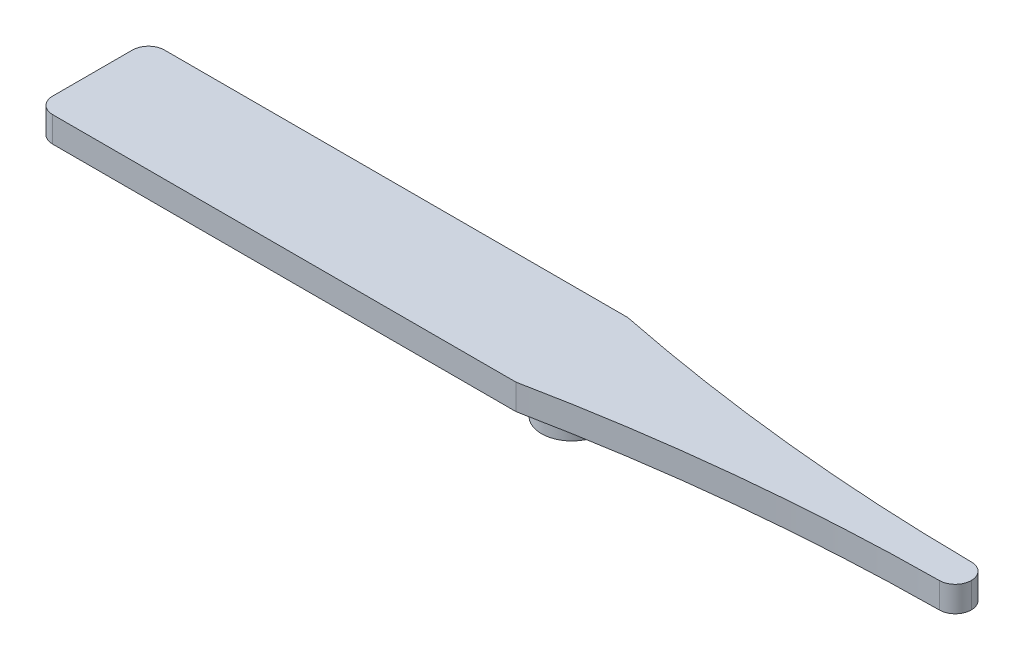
ISO-10303-21;
HEADER;
FILE_DESCRIPTION(('STEP AP214'),'2;1');
FILE_NAME('part.step','',(''),(''),'','','');
FILE_SCHEMA(('AUTOMOTIVE_DESIGN { 1 0 10303 214 1 1 1 1 }'));
ENDSEC;
DATA;
#1=APPLICATION_CONTEXT('core data for automotive mechanical design processes');
#2=APPLICATION_PROTOCOL_DEFINITION('international standard','automotive_design',2000,#1);
#3=PRODUCT_CONTEXT('',#1,'mechanical');
#4=PRODUCT('Part','Part','',(#3));
#5=PRODUCT_RELATED_PRODUCT_CATEGORY('part','',(#4));
#6=PRODUCT_DEFINITION_FORMATION('','',#4);
#7=PRODUCT_DEFINITION_CONTEXT('part definition',#1,'design');
#8=PRODUCT_DEFINITION('design','',#6,#7);
#9=PRODUCT_DEFINITION_SHAPE('','',#8);
#10=(LENGTH_UNIT() NAMED_UNIT(*) SI_UNIT(.MILLI.,.METRE.));
#11=(NAMED_UNIT(*) PLANE_ANGLE_UNIT() SI_UNIT($,.RADIAN.));
#12=(NAMED_UNIT(*) SI_UNIT($,.STERADIAN.) SOLID_ANGLE_UNIT());
#13=UNCERTAINTY_MEASURE_WITH_UNIT(LENGTH_MEASURE(1.E-05),#10,'distance_accuracy_value','');
#14=(GEOMETRIC_REPRESENTATION_CONTEXT(3) GLOBAL_UNCERTAINTY_ASSIGNED_CONTEXT((#13)) GLOBAL_UNIT_ASSIGNED_CONTEXT((#10,
#11,#12)) REPRESENTATION_CONTEXT('',''));
#15=CARTESIAN_POINT('',(0.,0.,0.));
#16=DIRECTION('',(0.,0.,1.));
#17=DIRECTION('',(1.,0.,0.));
#18=AXIS2_PLACEMENT_3D('',#15,#16,#17);
#19=CARTESIAN_POINT('',(25.,1.6,-127.25));
#20=DIRECTION('',(0.,-1.,0.));
#21=DIRECTION('',(0.,0.,-1.));
#22=AXIS2_PLACEMENT_3D('',#19,#20,#21);
#23=CYLINDRICAL_SURFACE('',#22,126.25);
#24=CARTESIAN_POINT('',(25.,0.,-127.25));
#25=DIRECTION('',(0.,1.,0.));
#26=DIRECTION('',(0.,0.,1.));
#27=AXIS2_PLACEMENT_3D('',#24,#25,#26);
#28=CIRCLE('',#27,126.25);
#29=CARTESIAN_POINT('',(0.0974471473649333,0.,-3.4803536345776));
#30=VERTEX_POINT('',#29);
#31=CARTESIAN_POINT('',(24.007858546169,0.,-1.00389845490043));
#32=VERTEX_POINT('',#31);
#33=EDGE_CURVE('E177',#30,#32,#28,.T.);
#34=ORIENTED_EDGE('',*,*,#33,.F.);
#35=DIRECTION('',(0.,-1.,0.));
#36=VECTOR('',#35,1.);
#37=CARTESIAN_POINT('',(0.0974471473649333,1.6,-3.4803536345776));
#38=LINE('',#37,#36);
#39=CARTESIAN_POINT('',(0.0974471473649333,1.6,-3.4803536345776));
#40=VERTEX_POINT('',#39);
#41=EDGE_CURVE('E221',#30,#40,#38,.F.);
#42=ORIENTED_EDGE('',*,*,#41,.T.);
#43=CARTESIAN_POINT('',(25.,1.6,-127.25));
#44=DIRECTION('',(0.,1.,0.));
#45=DIRECTION('',(0.,0.,1.));
#46=AXIS2_PLACEMENT_3D('',#43,#44,#45);
#47=CIRCLE('',#46,126.25);
#48=CARTESIAN_POINT('',(24.007858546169,1.6,-1.00389845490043));
#49=VERTEX_POINT('',#48);
#50=EDGE_CURVE('E263',#40,#49,#47,.T.);
#51=ORIENTED_EDGE('',*,*,#50,.T.);
#52=DIRECTION('',(0.,-1.,0.));
#53=VECTOR('',#52,1.);
#54=CARTESIAN_POINT('',(24.007858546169,1.6,-1.00389845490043));
#55=LINE('',#54,#53);
#56=EDGE_CURVE('E217',#49,#32,#55,.T.);
#57=ORIENTED_EDGE('',*,*,#56,.T.);
#58=EDGE_LOOP('',(#34,#42,#51,#57));
#59=FACE_BOUND('',#58,.T.);
#60=ADVANCED_FACE('F62',(#59),#23,.F.);
#61=CARTESIAN_POINT('',(0.,1.6,-3.5));
#62=DIRECTION('',(0.,0.,1.));
#63=DIRECTION('',(1.,0.,0.));
#64=AXIS2_PLACEMENT_3D('',#61,#62,#63);
#65=PLANE('',#64);
#66=DIRECTION('',(-1.,0.,0.));
#67=VECTOR('',#66,1.);
#68=CARTESIAN_POINT('',(0.,1.6,-3.5));
#69=LINE('',#68,#67);
#70=CARTESIAN_POINT('',(-0.0998007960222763,1.6,-3.5));
#71=VERTEX_POINT('',#70);
#72=CARTESIAN_POINT('',(-29.,1.6,-3.50000000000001));
#73=VERTEX_POINT('',#72);
#74=EDGE_CURVE('E169',#71,#73,#69,.T.);
#75=ORIENTED_EDGE('',*,*,#74,.F.);
#76=DIRECTION('',(0.,1.,0.));
#77=VECTOR('',#76,1.);
#78=CARTESIAN_POINT('',(-0.0998007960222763,0.,-3.5));
#79=LINE('',#78,#77);
#80=CARTESIAN_POINT('',(-0.0998007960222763,0.,-3.5));
#81=VERTEX_POINT('',#80);
#82=EDGE_CURVE('E198',#71,#81,#79,.F.);
#83=ORIENTED_EDGE('',*,*,#82,.T.);
#84=DIRECTION('',(-1.,0.,0.));
#85=VECTOR('',#84,1.);
#86=CARTESIAN_POINT('',(0.,0.,-3.5));
#87=LINE('',#86,#85);
#88=CARTESIAN_POINT('',(-29.,0.,-3.50000000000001));
#89=VERTEX_POINT('',#88);
#90=EDGE_CURVE('E182',#81,#89,#87,.T.);
#91=ORIENTED_EDGE('',*,*,#90,.T.);
#92=DIRECTION('',(0.,-1.,0.));
#93=VECTOR('',#92,1.);
#94=CARTESIAN_POINT('',(-29.,1.6,-3.50000000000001));
#95=LINE('',#94,#93);
#96=EDGE_CURVE('E156',#89,#73,#95,.F.);
#97=ORIENTED_EDGE('',*,*,#96,.T.);
#98=EDGE_LOOP('',(#75,#83,#91,#97));
#99=FACE_BOUND('',#98,.T.);
#100=ADVANCED_FACE('F279',(#99),#65,.F.);
#101=CARTESIAN_POINT('',(-30.,1.6,0.));
#102=DIRECTION('',(1.,0.,0.));
#103=DIRECTION('',(0.,0.,-1.));
#104=AXIS2_PLACEMENT_3D('',#101,#102,#103);
#105=PLANE('',#104);
#106=DIRECTION('',(0.,0.,1.));
#107=VECTOR('',#106,1.);
#108=CARTESIAN_POINT('',(-30.,1.6,0.));
#109=LINE('',#108,#107);
#110=CARTESIAN_POINT('',(-30.,1.6,-2.50000000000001));
#111=VERTEX_POINT('',#110);
#112=CARTESIAN_POINT('',(-30.,1.6,2.50000000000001));
#113=VERTEX_POINT('',#112);
#114=EDGE_CURVE('E166',#111,#113,#109,.T.);
#115=ORIENTED_EDGE('',*,*,#114,.F.);
#116=DIRECTION('',(0.,-1.,0.));
#117=VECTOR('',#116,1.);
#118=CARTESIAN_POINT('',(-30.,1.6,-2.50000000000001));
#119=LINE('',#118,#117);
#120=CARTESIAN_POINT('',(-30.,0.,-2.50000000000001));
#121=VERTEX_POINT('',#120);
#122=EDGE_CURVE('E241',#111,#121,#119,.T.);
#123=ORIENTED_EDGE('',*,*,#122,.T.);
#124=DIRECTION('',(0.,0.,1.));
#125=VECTOR('',#124,1.);
#126=CARTESIAN_POINT('',(-30.,0.,0.));
#127=LINE('',#126,#125);
#128=CARTESIAN_POINT('',(-30.,0.,2.50000000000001));
#129=VERTEX_POINT('',#128);
#130=EDGE_CURVE('E186',#121,#129,#127,.T.);
#131=ORIENTED_EDGE('',*,*,#130,.T.);
#132=DIRECTION('',(0.,-1.,0.));
#133=VECTOR('',#132,1.);
#134=CARTESIAN_POINT('',(-30.,1.6,2.50000000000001));
#135=LINE('',#134,#133);
#136=EDGE_CURVE('E238',#129,#113,#135,.F.);
#137=ORIENTED_EDGE('',*,*,#136,.T.);
#138=EDGE_LOOP('',(#115,#123,#131,#137));
#139=FACE_BOUND('',#138,.T.);
#140=ADVANCED_FACE('F313',(#139),#105,.F.);
#141=CARTESIAN_POINT('',(0.,1.6,3.5));
#142=DIRECTION('',(0.,0.,1.));
#143=DIRECTION('',(1.,0.,0.));
#144=AXIS2_PLACEMENT_3D('',#141,#142,#143);
#145=PLANE('',#144);
#146=DIRECTION('',(-1.,0.,0.));
#147=VECTOR('',#146,1.);
#148=CARTESIAN_POINT('',(0.,1.6,3.5));
#149=LINE('',#148,#147);
#150=CARTESIAN_POINT('',(0.,1.6,3.5));
#151=VERTEX_POINT('',#150);
#152=CARTESIAN_POINT('',(-29.,1.6,3.50000000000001));
#153=VERTEX_POINT('',#152);
#154=EDGE_CURVE('E150',#151,#153,#149,.T.);
#155=ORIENTED_EDGE('',*,*,#154,.T.);
#156=DIRECTION('',(0.,-1.,0.));
#157=VECTOR('',#156,1.);
#158=CARTESIAN_POINT('',(-29.,0.,3.50000000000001));
#159=LINE('',#158,#157);
#160=CARTESIAN_POINT('',(-29.,0.,3.50000000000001));
#161=VERTEX_POINT('',#160);
#162=EDGE_CURVE('E245',#153,#161,#159,.T.);
#163=ORIENTED_EDGE('',*,*,#162,.T.);
#164=DIRECTION('',(-1.,0.,0.));
#165=VECTOR('',#164,1.);
#166=CARTESIAN_POINT('',(0.,0.,3.5));
#167=LINE('',#166,#165);
#168=CARTESIAN_POINT('',(0.,0.,3.5));
#169=VERTEX_POINT('',#168);
#170=EDGE_CURVE('E153',#169,#161,#167,.T.);
#171=ORIENTED_EDGE('',*,*,#170,.F.);
#172=DIRECTION('',(0.,-1.,0.));
#173=VECTOR('',#172,1.);
#174=CARTESIAN_POINT('',(0.,1.6,3.5));
#175=LINE('',#174,#173);
#176=EDGE_CURVE('E147',#151,#169,#175,.T.);
#177=ORIENTED_EDGE('',*,*,#176,.F.);
#178=EDGE_LOOP('',(#155,#163,#171,#177));
#179=FACE_BOUND('',#178,.T.);
#180=ADVANCED_FACE('F148',(#179),#145,.T.);
#181=CARTESIAN_POINT('',(25.,1.6,127.25));
#182=DIRECTION('',(0.,-1.,0.));
#183=DIRECTION('',(0.,0.,-1.));
#184=AXIS2_PLACEMENT_3D('',#181,#182,#183);
#185=CYLINDRICAL_SURFACE('',#184,126.25);
#186=CARTESIAN_POINT('',(25.,0.,127.25));
#187=DIRECTION('',(0.,1.,0.));
#188=DIRECTION('',(0.,0.,1.));
#189=AXIS2_PLACEMENT_3D('',#186,#187,#188);
#190=CIRCLE('',#189,126.25);
#191=CARTESIAN_POINT('',(24.007858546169,0.,1.00389845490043));
#192=VERTEX_POINT('',#191);
#193=EDGE_CURVE('E192',#169,#192,#190,.F.);
#194=ORIENTED_EDGE('',*,*,#193,.T.);
#195=DIRECTION('',(0.,-1.,0.));
#196=VECTOR('',#195,1.);
#197=CARTESIAN_POINT('',(24.007858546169,1.6,1.00389845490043));
#198=LINE('',#197,#196);
#199=CARTESIAN_POINT('',(24.007858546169,1.6,1.00389845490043));
#200=VERTEX_POINT('',#199);
#201=EDGE_CURVE('E12',#192,#200,#198,.F.);
#202=ORIENTED_EDGE('',*,*,#201,.T.);
#203=CARTESIAN_POINT('',(25.,1.6,127.25));
#204=DIRECTION('',(0.,1.,0.));
#205=DIRECTION('',(0.,0.,1.));
#206=AXIS2_PLACEMENT_3D('',#203,#204,#205);
#207=CIRCLE('',#206,126.25);
#208=EDGE_CURVE('E157',#151,#200,#207,.F.);
#209=ORIENTED_EDGE('',*,*,#208,.F.);
#210=ORIENTED_EDGE('',*,*,#176,.T.);
#211=EDGE_LOOP('',(#194,#202,#209,#210));
#212=FACE_BOUND('',#211,.T.);
#213=ADVANCED_FACE('F159',(#212),#185,.F.);
#214=CARTESIAN_POINT('',(25.,1.6,0.));
#215=DIRECTION('',(1.,0.,0.));
#216=DIRECTION('',(0.,0.,-1.));
#217=AXIS2_PLACEMENT_3D('',#214,#215,#216);
#218=PLANE('',#217);
#219=DIRECTION('',(0.,0.,1.));
#220=VECTOR('',#219,1.);
#221=CARTESIAN_POINT('',(25.,0.,0.));
#222=LINE('',#221,#220);
#223=CARTESIAN_POINT('',(25.,0.,-0.00392933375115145));
#224=VERTEX_POINT('',#223);
#225=CARTESIAN_POINT('',(25.,0.,0.00392933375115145));
#226=VERTEX_POINT('',#225);
#227=EDGE_CURVE('E173',#224,#226,#222,.T.);
#228=ORIENTED_EDGE('',*,*,#227,.F.);
#229=DIRECTION('',(0.,-1.,0.));
#230=VECTOR('',#229,1.);
#231=CARTESIAN_POINT('',(25.,1.6,-0.00392933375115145));
#232=LINE('',#231,#230);
#233=CARTESIAN_POINT('',(25.,1.6,-0.00392933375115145));
#234=VERTEX_POINT('',#233);
#235=EDGE_CURVE('E71',#224,#234,#232,.F.);
#236=ORIENTED_EDGE('',*,*,#235,.T.);
#237=DIRECTION('',(0.,0.,1.));
#238=VECTOR('',#237,1.);
#239=CARTESIAN_POINT('',(25.,1.6,0.));
#240=LINE('',#239,#238);
#241=CARTESIAN_POINT('',(25.,1.6,0.00392933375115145));
#242=VERTEX_POINT('',#241);
#243=EDGE_CURVE('E194',#234,#242,#240,.T.);
#244=ORIENTED_EDGE('',*,*,#243,.T.);
#245=DIRECTION('',(0.,1.,0.));
#246=VECTOR('',#245,1.);
#247=CARTESIAN_POINT('',(25.,0.,0.00392933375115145));
#248=LINE('',#247,#246);
#249=EDGE_CURVE('E248',#242,#226,#248,.F.);
#250=ORIENTED_EDGE('',*,*,#249,.T.);
#251=EDGE_LOOP('',(#228,#236,#244,#250));
#252=FACE_BOUND('',#251,.T.);
#253=ADVANCED_FACE('F257',(#252),#218,.T.);
#254=CARTESIAN_POINT('',(0.,0.,0.));
#255=DIRECTION('',(0.,1.,0.));
#256=DIRECTION('',(0.,0.,1.));
#257=AXIS2_PLACEMENT_3D('',#254,#255,#256);
#258=PLANE('',#257);
#259=CARTESIAN_POINT('',(0.,0.,0.));
#260=DIRECTION('',(0.,1.,0.));
#261=DIRECTION('',(0.,0.,1.));
#262=AXIS2_PLACEMENT_3D('',#259,#260,#261);
#263=CIRCLE('',#262,1.9);
#264=CARTESIAN_POINT('',(0.,0.,1.9));
#265=VERTEX_POINT('',#264);
#266=EDGE_CURVE('E287',#265,#265,#263,.T.);
#267=ORIENTED_EDGE('',*,*,#266,.T.);
#268=EDGE_LOOP('',(#267));
#269=FACE_BOUND('',#268,.T.);
#270=ORIENTED_EDGE('',*,*,#90,.F.);
#271=CARTESIAN_POINT('',(-0.0998007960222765,0.,-2.50000000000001));
#272=DIRECTION('',(0.,1.,0.));
#273=DIRECTION('',(0.,0.,1.));
#274=AXIS2_PLACEMENT_3D('',#271,#272,#273);
#275=CIRCLE('',#274,1.);
#276=EDGE_CURVE('E214',#81,#30,#275,.F.);
#277=ORIENTED_EDGE('',*,*,#276,.T.);
#278=ORIENTED_EDGE('',*,*,#33,.T.);
#279=CARTESIAN_POINT('',(24.,0.,-0.00392933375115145));
#280=DIRECTION('',(0.,1.,0.));
#281=DIRECTION('',(0.,0.,1.));
#282=AXIS2_PLACEMENT_3D('',#279,#280,#281);
#283=CIRCLE('',#282,1.);
#284=EDGE_CURVE('E205',#32,#224,#283,.F.);
#285=ORIENTED_EDGE('',*,*,#284,.T.);
#286=ORIENTED_EDGE('',*,*,#227,.T.);
#287=CARTESIAN_POINT('',(24.,0.,0.00392933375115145));
#288=DIRECTION('',(0.,1.,0.));
#289=DIRECTION('',(0.,0.,1.));
#290=AXIS2_PLACEMENT_3D('',#287,#288,#289);
#291=CIRCLE('',#290,1.);
#292=EDGE_CURVE('E202',#226,#192,#291,.F.);
#293=ORIENTED_EDGE('',*,*,#292,.T.);
#294=ORIENTED_EDGE('',*,*,#193,.F.);
#295=ORIENTED_EDGE('',*,*,#170,.T.);
#296=CARTESIAN_POINT('',(-29.,0.,2.50000000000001));
#297=DIRECTION('',(0.,1.,0.));
#298=DIRECTION('',(0.,0.,1.));
#299=AXIS2_PLACEMENT_3D('',#296,#297,#298);
#300=CIRCLE('',#299,1.);
#301=EDGE_CURVE('E208',#161,#129,#300,.F.);
#302=ORIENTED_EDGE('',*,*,#301,.T.);
#303=ORIENTED_EDGE('',*,*,#130,.F.);
#304=CARTESIAN_POINT('',(-29.,0.,-2.50000000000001));
#305=DIRECTION('',(0.,1.,0.));
#306=DIRECTION('',(0.,0.,1.));
#307=AXIS2_PLACEMENT_3D('',#304,#305,#306);
#308=CIRCLE('',#307,1.);
#309=EDGE_CURVE('E211',#121,#89,#308,.F.);
#310=ORIENTED_EDGE('',*,*,#309,.T.);
#311=EDGE_LOOP('',(#270,#277,#278,#285,#286,#293,#294,#295,#302,#303,#310));
#312=FACE_BOUND('',#311,.T.);
#313=ADVANCED_FACE('F272',(#269,#312),#258,.F.);
#314=CARTESIAN_POINT('',(0.,1.6,0.));
#315=DIRECTION('',(0.,1.,0.));
#316=DIRECTION('',(0.,0.,1.));
#317=AXIS2_PLACEMENT_3D('',#314,#315,#316);
#318=PLANE('',#317);
#319=ORIENTED_EDGE('',*,*,#50,.F.);
#320=CARTESIAN_POINT('',(-0.0998007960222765,1.6,-2.50000000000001));
#321=DIRECTION('',(0.,1.,0.));
#322=DIRECTION('',(0.,0.,1.));
#323=AXIS2_PLACEMENT_3D('',#320,#321,#322);
#324=CIRCLE('',#323,1.);
#325=EDGE_CURVE('E235',#40,#71,#324,.T.);
#326=ORIENTED_EDGE('',*,*,#325,.T.);
#327=ORIENTED_EDGE('',*,*,#74,.T.);
#328=CARTESIAN_POINT('',(-29.,1.6,-2.50000000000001));
#329=DIRECTION('',(0.,1.,0.));
#330=DIRECTION('',(0.,0.,1.));
#331=AXIS2_PLACEMENT_3D('',#328,#329,#330);
#332=CIRCLE('',#331,1.);
#333=EDGE_CURVE('E232',#73,#111,#332,.T.);
#334=ORIENTED_EDGE('',*,*,#333,.T.);
#335=ORIENTED_EDGE('',*,*,#114,.T.);
#336=CARTESIAN_POINT('',(-29.,1.6,2.50000000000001));
#337=DIRECTION('',(0.,1.,0.));
#338=DIRECTION('',(0.,0.,1.));
#339=AXIS2_PLACEMENT_3D('',#336,#337,#338);
#340=CIRCLE('',#339,1.);
#341=EDGE_CURVE('E84',#113,#153,#340,.T.);
#342=ORIENTED_EDGE('',*,*,#341,.T.);
#343=ORIENTED_EDGE('',*,*,#154,.F.);
#344=ORIENTED_EDGE('',*,*,#208,.T.);
#345=CARTESIAN_POINT('',(24.,1.6,0.00392933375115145));
#346=DIRECTION('',(0.,1.,0.));
#347=DIRECTION('',(0.,0.,1.));
#348=AXIS2_PLACEMENT_3D('',#345,#346,#347);
#349=CIRCLE('',#348,1.);
#350=EDGE_CURVE('E224',#200,#242,#349,.T.);
#351=ORIENTED_EDGE('',*,*,#350,.T.);
#352=ORIENTED_EDGE('',*,*,#243,.F.);
#353=CARTESIAN_POINT('',(24.,1.6,-0.00392933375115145));
#354=DIRECTION('',(0.,1.,0.));
#355=DIRECTION('',(0.,0.,1.));
#356=AXIS2_PLACEMENT_3D('',#353,#354,#355);
#357=CIRCLE('',#356,1.);
#358=EDGE_CURVE('E227',#234,#49,#357,.T.);
#359=ORIENTED_EDGE('',*,*,#358,.T.);
#360=EDGE_LOOP('',(#319,#326,#327,#334,#335,#342,#343,#344,#351,#352,#359));
#361=FACE_BOUND('',#360,.T.);
#362=ADVANCED_FACE('F164',(#361),#318,.T.);
#363=CARTESIAN_POINT('',(0.,-2.,0.));
#364=DIRECTION('',(0.,1.,0.));
#365=DIRECTION('',(0.,0.,1.));
#366=AXIS2_PLACEMENT_3D('',#363,#364,#365);
#367=CYLINDRICAL_SURFACE('',#366,1.9);
#368=CARTESIAN_POINT('',(0.,-2.,0.));
#369=DIRECTION('',(0.,1.,0.));
#370=DIRECTION('',(0.,0.,1.));
#371=AXIS2_PLACEMENT_3D('',#368,#369,#370);
#372=CIRCLE('',#371,1.9);
#373=CARTESIAN_POINT('',(0.,-2.,1.9));
#374=VERTEX_POINT('',#373);
#375=EDGE_CURVE('E178',#374,#374,#372,.T.);
#376=ORIENTED_EDGE('',*,*,#375,.T.);
#377=EDGE_LOOP('',(#376));
#378=FACE_BOUND('',#377,.T.);
#379=ORIENTED_EDGE('',*,*,#266,.F.);
#380=EDGE_LOOP('',(#379));
#381=FACE_BOUND('',#380,.T.);
#382=ADVANCED_FACE('F295',(#378,#381),#367,.T.);
#383=CARTESIAN_POINT('',(0.,-2.,0.));
#384=DIRECTION('',(0.,1.,0.));
#385=DIRECTION('',(0.,0.,1.));
#386=AXIS2_PLACEMENT_3D('',#383,#384,#385);
#387=PLANE('',#386);
#388=ORIENTED_EDGE('',*,*,#375,.F.);
#389=EDGE_LOOP('',(#388));
#390=FACE_BOUND('',#389,.T.);
#391=ADVANCED_FACE('F298',(#390),#387,.F.);
#392=CARTESIAN_POINT('',(-0.0998007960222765,1.6,-2.50000000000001));
#393=DIRECTION('',(0.,-1.,0.));
#394=DIRECTION('',(0.,0.,-1.));
#395=AXIS2_PLACEMENT_3D('',#392,#393,#394);
#396=CYLINDRICAL_SURFACE('',#395,1.);
#397=ORIENTED_EDGE('',*,*,#325,.F.);
#398=ORIENTED_EDGE('',*,*,#41,.F.);
#399=ORIENTED_EDGE('',*,*,#276,.F.);
#400=ORIENTED_EDGE('',*,*,#82,.F.);
#401=EDGE_LOOP('',(#397,#398,#399,#400));
#402=FACE_BOUND('',#401,.T.);
#403=ADVANCED_FACE('F276',(#402),#396,.T.);
#404=CARTESIAN_POINT('',(-29.,1.6,-2.50000000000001));
#405=DIRECTION('',(0.,-1.,0.));
#406=DIRECTION('',(0.,0.,-1.));
#407=AXIS2_PLACEMENT_3D('',#404,#405,#406);
#408=CYLINDRICAL_SURFACE('',#407,1.);
#409=ORIENTED_EDGE('',*,*,#333,.F.);
#410=ORIENTED_EDGE('',*,*,#96,.F.);
#411=ORIENTED_EDGE('',*,*,#309,.F.);
#412=ORIENTED_EDGE('',*,*,#122,.F.);
#413=EDGE_LOOP('',(#409,#410,#411,#412));
#414=FACE_BOUND('',#413,.T.);
#415=ADVANCED_FACE('F305',(#414),#408,.T.);
#416=CARTESIAN_POINT('',(-29.,1.6,2.50000000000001));
#417=DIRECTION('',(0.,1.,0.));
#418=DIRECTION('',(0.,0.,1.));
#419=AXIS2_PLACEMENT_3D('',#416,#417,#418);
#420=CYLINDRICAL_SURFACE('',#419,1.);
#421=ORIENTED_EDGE('',*,*,#341,.F.);
#422=ORIENTED_EDGE('',*,*,#136,.F.);
#423=ORIENTED_EDGE('',*,*,#301,.F.);
#424=ORIENTED_EDGE('',*,*,#162,.F.);
#425=EDGE_LOOP('',(#421,#422,#423,#424));
#426=FACE_BOUND('',#425,.T.);
#427=ADVANCED_FACE('F321',(#426),#420,.T.);
#428=CARTESIAN_POINT('',(24.,1.6,-0.00392933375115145));
#429=DIRECTION('',(0.,-1.,0.));
#430=DIRECTION('',(0.,0.,-1.));
#431=AXIS2_PLACEMENT_3D('',#428,#429,#430);
#432=CYLINDRICAL_SURFACE('',#431,1.);
#433=ORIENTED_EDGE('',*,*,#358,.F.);
#434=ORIENTED_EDGE('',*,*,#235,.F.);
#435=ORIENTED_EDGE('',*,*,#284,.F.);
#436=ORIENTED_EDGE('',*,*,#56,.F.);
#437=EDGE_LOOP('',(#433,#434,#435,#436));
#438=FACE_BOUND('',#437,.T.);
#439=ADVANCED_FACE('F266',(#438),#432,.T.);
#440=CARTESIAN_POINT('',(24.,1.6,0.00392933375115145));
#441=DIRECTION('',(0.,-1.,0.));
#442=DIRECTION('',(0.,0.,-1.));
#443=AXIS2_PLACEMENT_3D('',#440,#441,#442);
#444=CYLINDRICAL_SURFACE('',#443,1.);
#445=ORIENTED_EDGE('',*,*,#350,.F.);
#446=ORIENTED_EDGE('',*,*,#201,.F.);
#447=ORIENTED_EDGE('',*,*,#292,.F.);
#448=ORIENTED_EDGE('',*,*,#249,.F.);
#449=EDGE_LOOP('',(#445,#446,#447,#448));
#450=FACE_BOUND('',#449,.T.);
#451=ADVANCED_FACE('F64',(#450),#444,.T.);
#452=CLOSED_SHELL('',(#60,#100,#140,#180,#213,#253,#313,#362,#382,#391,#403,#415,#427,#439,#451));
#453=MANIFOLD_SOLID_BREP('B2',#452);
#454=ADVANCED_BREP_SHAPE_REPRESENTATION('',(#18,#453),#14);
#455=SHAPE_DEFINITION_REPRESENTATION(#9,#454);
ENDSEC;
END-ISO-10303-21;
